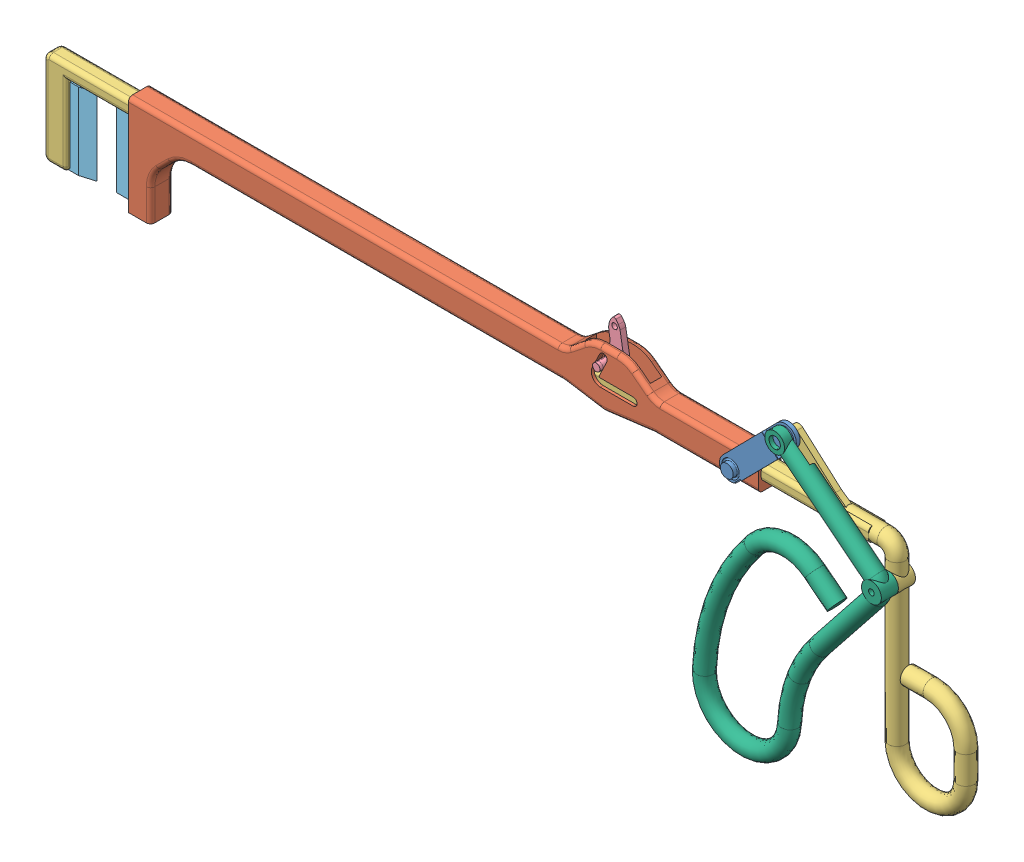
SolidWorks assembly Surgical_shear.SLDASM, configuration Default (file format 11000). Lengths in mm.
Overall size (324.49 112.34 14.22).
7 component instances, 6 part files, 0 mates.
Components (placement in the parent):
- handle_link-1: handle_link.SLDPRT [Default] at (67.1911 -69.521 4.9276) x (-0.008901 0.99996 0) z (0 0 -1) size (26.24 26.32 4.42)
- moving_cutter-1: moving_cutter.SLDPRT [Curve_Curve] at (86.3651 19.9922 -2.6792) size (221.63 42.64 8)
- fixed_cutter-1: fixed_cutter.SLDPRT [Default] at (-3.4565 0 -2.6792) size (324.49 93.22 6)
- latch-1: latch.SLDPRT [Default] at (138.1413 63.0517 -2.6792) x (-0.819376 -0.573257 0) z (0 0 -1) size (16 23.63 10)
- blade-1: blade.SLDPRT [Default] at (-366.9458 19.3504 -2.6792) x (-1 0 0) z (0 1 0) size (12 3 27)
- blade-2: blade.SLDPRT [Default] at (88.192 19.3504 -2.6792) x (1 0 0) z (0 1 0) size (12 3 27)
- handle-1: handle.SLDPRT [Default] at (118.7799 -2.4466 3.3208) x (0 0 -1) z (0.993542 0.113468 0) size (6.43 104.57 74.36)
